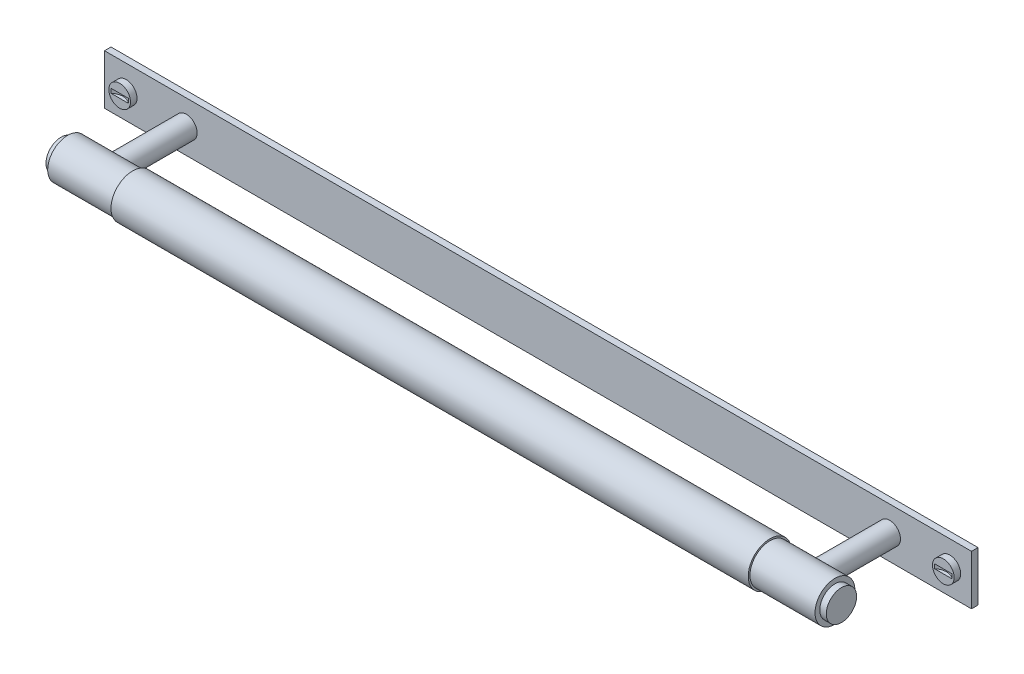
ISO-10303-21;
HEADER;
FILE_DESCRIPTION(('STEP AP214'),'2;1');
FILE_NAME('part.step','',(''),(''),'','','');
FILE_SCHEMA(('AUTOMOTIVE_DESIGN { 1 0 10303 214 1 1 1 1 }'));
ENDSEC;
DATA;
#1=APPLICATION_CONTEXT('core data for automotive mechanical design processes');
#2=APPLICATION_PROTOCOL_DEFINITION('international standard','automotive_design',2000,#1);
#3=PRODUCT_CONTEXT('',#1,'mechanical');
#4=PRODUCT('Part','Part','',(#3));
#5=PRODUCT_RELATED_PRODUCT_CATEGORY('part','',(#4));
#6=PRODUCT_DEFINITION_FORMATION('','',#4);
#7=PRODUCT_DEFINITION_CONTEXT('part definition',#1,'design');
#8=PRODUCT_DEFINITION('design','',#6,#7);
#9=PRODUCT_DEFINITION_SHAPE('','',#8);
#10=(LENGTH_UNIT() NAMED_UNIT(*) SI_UNIT(.MILLI.,.METRE.));
#11=(NAMED_UNIT(*) PLANE_ANGLE_UNIT() SI_UNIT($,.RADIAN.));
#12=(NAMED_UNIT(*) SI_UNIT($,.STERADIAN.) SOLID_ANGLE_UNIT());
#13=UNCERTAINTY_MEASURE_WITH_UNIT(LENGTH_MEASURE(1.E-05),#10,'distance_accuracy_value','');
#14=(GEOMETRIC_REPRESENTATION_CONTEXT(3) GLOBAL_UNCERTAINTY_ASSIGNED_CONTEXT((#13)) GLOBAL_UNIT_ASSIGNED_CONTEXT((#10,
#11,#12)) REPRESENTATION_CONTEXT('',''));
#15=CARTESIAN_POINT('',(0.,0.,0.));
#16=DIRECTION('',(0.,0.,1.));
#17=DIRECTION('',(1.,0.,0.));
#18=AXIS2_PLACEMENT_3D('',#15,#16,#17);
#19=CARTESIAN_POINT('',(200.,-11.5,-40.));
#20=DIRECTION('',(0.,0.,-1.));
#21=DIRECTION('',(-1.,0.,0.));
#22=AXIS2_PLACEMENT_3D('',#19,#20,#21);
#23=PLANE('',#22);
#24=CARTESIAN_POINT('',(-190.,0.,-40.));
#25=DIRECTION('',(0.,0.,-1.));
#26=DIRECTION('',(-1.,0.,0.));
#27=AXIS2_PLACEMENT_3D('',#24,#25,#26);
#28=CIRCLE('',#27,4.99999999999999);
#29=CARTESIAN_POINT('',(-195.,0.,-40.));
#30=VERTEX_POINT('',#29);
#31=EDGE_CURVE('E111',#30,#30,#28,.T.);
#32=ORIENTED_EDGE('',*,*,#31,.T.);
#33=EDGE_LOOP('',(#32));
#34=FACE_BOUND('',#33,.T.);
#35=CARTESIAN_POINT('',(162.25,0.,-40.));
#36=DIRECTION('',(0.,0.,-1.));
#37=DIRECTION('',(-1.,0.,0.));
#38=AXIS2_PLACEMENT_3D('',#35,#36,#37);
#39=CIRCLE('',#38,4.99999999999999);
#40=CARTESIAN_POINT('',(157.25,0.,-40.));
#41=VERTEX_POINT('',#40);
#42=EDGE_CURVE('E165',#41,#41,#39,.T.);
#43=ORIENTED_EDGE('',*,*,#42,.T.);
#44=EDGE_LOOP('',(#43));
#45=FACE_BOUND('',#44,.T.);
#46=DIRECTION('',(0.,-1.,0.));
#47=VECTOR('',#46,1.);
#48=CARTESIAN_POINT('',(-200.,-11.5,-40.));
#49=LINE('',#48,#47);
#50=CARTESIAN_POINT('',(-200.,11.5,-40.));
#51=VERTEX_POINT('',#50);
#52=CARTESIAN_POINT('',(-200.,-11.5,-40.));
#53=VERTEX_POINT('',#52);
#54=EDGE_CURVE('E148',#51,#53,#49,.T.);
#55=ORIENTED_EDGE('',*,*,#54,.T.);
#56=DIRECTION('',(-1.,0.,0.));
#57=VECTOR('',#56,1.);
#58=CARTESIAN_POINT('',(200.,-11.5,-40.));
#59=LINE('',#58,#57);
#60=CARTESIAN_POINT('',(200.,-11.5,-40.));
#61=VERTEX_POINT('',#60);
#62=EDGE_CURVE('E153',#61,#53,#59,.T.);
#63=ORIENTED_EDGE('',*,*,#62,.F.);
#64=DIRECTION('',(0.,-1.,0.));
#65=VECTOR('',#64,1.);
#66=CARTESIAN_POINT('',(200.,-11.5,-40.));
#67=LINE('',#66,#65);
#68=CARTESIAN_POINT('',(200.,11.5,-40.));
#69=VERTEX_POINT('',#68);
#70=EDGE_CURVE('E139',#69,#61,#67,.T.);
#71=ORIENTED_EDGE('',*,*,#70,.F.);
#72=DIRECTION('',(-1.,0.,0.));
#73=VECTOR('',#72,1.);
#74=CARTESIAN_POINT('',(200.,11.5,-40.));
#75=LINE('',#74,#73);
#76=EDGE_CURVE('E156',#69,#51,#75,.T.);
#77=ORIENTED_EDGE('',*,*,#76,.T.);
#78=EDGE_LOOP('',(#55,#63,#71,#77));
#79=FACE_BOUND('',#78,.T.);
#80=CARTESIAN_POINT('',(-162.25,0.,-40.));
#81=DIRECTION('',(0.,0.,-1.));
#82=DIRECTION('',(-1.,0.,0.));
#83=AXIS2_PLACEMENT_3D('',#80,#81,#82);
#84=CIRCLE('',#83,4.99999999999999);
#85=CARTESIAN_POINT('',(-167.25,0.,-40.));
#86=VERTEX_POINT('',#85);
#87=EDGE_CURVE('E162',#86,#86,#84,.F.);
#88=ORIENTED_EDGE('',*,*,#87,.F.);
#89=EDGE_LOOP('',(#88));
#90=FACE_BOUND('',#89,.T.);
#91=CARTESIAN_POINT('',(190.,0.,-40.));
#92=DIRECTION('',(0.,0.,-1.));
#93=DIRECTION('',(-1.,0.,0.));
#94=AXIS2_PLACEMENT_3D('',#91,#92,#93);
#95=CIRCLE('',#94,4.99999999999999);
#96=CARTESIAN_POINT('',(185.,0.,-40.));
#97=VERTEX_POINT('',#96);
#98=EDGE_CURVE('E285',#97,#97,#95,.F.);
#99=ORIENTED_EDGE('',*,*,#98,.F.);
#100=EDGE_LOOP('',(#99));
#101=FACE_BOUND('',#100,.T.);
#102=ADVANCED_FACE('F32',(#34,#45,#79,#90,#101),#23,.F.);
#103=CARTESIAN_POINT('',(177.,0.,0.));
#104=DIRECTION('',(-1.,0.,0.));
#105=DIRECTION('',(0.,0.,1.));
#106=AXIS2_PLACEMENT_3D('',#103,#104,#105);
#107=CYLINDRICAL_SURFACE('',#106,9.2);
#108=CARTESIAN_POINT('',(147.,0.,0.));
#109=DIRECTION('',(1.,0.,0.));
#110=DIRECTION('',(0.,0.,-1.));
#111=AXIS2_PLACEMENT_3D('',#108,#109,#110);
#112=CIRCLE('',#111,9.2);
#113=CARTESIAN_POINT('',(147.,0.,-9.2));
#114=VERTEX_POINT('',#113);
#115=EDGE_CURVE('E181',#114,#114,#112,.T.);
#116=ORIENTED_EDGE('',*,*,#115,.T.);
#117=EDGE_LOOP('',(#116));
#118=FACE_BOUND('',#117,.T.);
#119=CARTESIAN_POINT('',(177.,0.,0.));
#120=DIRECTION('',(1.,0.,0.));
#121=DIRECTION('',(0.,0.,-1.));
#122=AXIS2_PLACEMENT_3D('',#119,#120,#121);
#123=CIRCLE('',#122,9.2);
#124=CARTESIAN_POINT('',(177.,0.,-9.2));
#125=VERTEX_POINT('',#124);
#126=EDGE_CURVE('E184',#125,#125,#123,.T.);
#127=ORIENTED_EDGE('',*,*,#126,.F.);
#128=EDGE_LOOP('',(#127));
#129=FACE_BOUND('',#128,.T.);
#130=CARTESIAN_POINT('',(167.25,0.,-9.2));
#131=CARTESIAN_POINT('',(167.250001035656,-0.130074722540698,-9.20000090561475));
#132=CARTESIAN_POINT('',(167.244919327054,-0.260136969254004,-9.19723589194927));
#133=CARTESIAN_POINT('',(167.224659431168,-0.519285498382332,-9.18624856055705));
#134=CARTESIAN_POINT('',(167.209478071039,-0.648371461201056,-9.17802452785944));
#135=CARTESIAN_POINT('',(167.169189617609,-0.904665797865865,-9.15631689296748));
#136=CARTESIAN_POINT('',(167.144072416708,-1.03187212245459,-9.14282793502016));
#137=CARTESIAN_POINT('',(167.084208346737,-1.28341476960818,-9.11092364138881));
#138=CARTESIAN_POINT('',(167.04945754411,-1.40774989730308,-9.0925062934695));
#139=CARTESIAN_POINT('',(166.970895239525,-1.65213298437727,-9.05128374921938));
#140=CARTESIAN_POINT('',(166.927125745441,-1.77219789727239,-9.02849892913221));
#141=CARTESIAN_POINT('',(166.83086498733,-2.00796183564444,-8.9790104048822));
#142=CARTESIAN_POINT('',(166.778370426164,-2.12365919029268,-8.95230521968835));
#143=CARTESIAN_POINT('',(166.608525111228,-2.46316888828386,-8.86719116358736));
#144=CARTESIAN_POINT('',(166.478734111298,-2.67964052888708,-8.80374126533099));
#145=CARTESIAN_POINT('',(166.179944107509,-3.10276985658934,-8.66405646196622));
#146=CARTESIAN_POINT('',(166.008884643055,-3.30776927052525,-8.58724663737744));
#147=CARTESIAN_POINT('',(165.636938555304,-3.68774436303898,-8.4310608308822));
#148=CARTESIAN_POINT('',(165.436025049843,-3.86269267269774,-8.35168258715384));
#149=CARTESIAN_POINT('',(164.986960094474,-4.19453179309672,-8.19042783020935));
#150=CARTESIAN_POINT('',(164.736128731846,-4.34809630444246,-8.10903821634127));
#151=CARTESIAN_POINT('',(164.340003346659,-4.54463175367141,-7.99949849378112));
#152=CARTESIAN_POINT('',(164.20460087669,-4.60452242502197,-7.96506681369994));
#153=CARTESIAN_POINT('',(163.927917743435,-4.7123873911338,-7.90172843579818));
#154=CARTESIAN_POINT('',(163.786640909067,-4.76036931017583,-7.87281820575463));
#155=CARTESIAN_POINT('',(163.508188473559,-4.84114175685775,-7.82339132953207));
#156=CARTESIAN_POINT('',(163.371306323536,-4.87469290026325,-7.80246375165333));
#157=CARTESIAN_POINT('',(163.094408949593,-4.9302019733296,-7.76750851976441));
#158=CARTESIAN_POINT('',(162.954395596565,-4.95216664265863,-7.75347685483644));
#159=CARTESIAN_POINT('',(162.67258350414,-4.98412633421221,-7.73297147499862));
#160=CARTESIAN_POINT('',(162.530786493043,-4.99413215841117,-7.72649093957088));
#161=CARTESIAN_POINT('',(162.246722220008,-5.0020165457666,-7.72138953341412));
#162=CARTESIAN_POINT('',(162.104455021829,-4.99989669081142,-7.72276763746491));
#163=CARTESIAN_POINT('',(161.841925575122,-4.98478878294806,-7.73252471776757));
#164=CARTESIAN_POINT('',(161.721523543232,-4.97345607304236,-7.73983711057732));
#165=CARTESIAN_POINT('',(161.482260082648,-4.942179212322,-7.75984601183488));
#166=CARTESIAN_POINT('',(161.363399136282,-4.92223242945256,-7.77254416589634));
#167=CARTESIAN_POINT('',(161.12803831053,-4.87397481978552,-7.80289558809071));
#168=CARTESIAN_POINT('',(161.011538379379,-4.84566417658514,-7.82054874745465));
#169=CARTESIAN_POINT('',(160.781543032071,-4.78099629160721,-7.86024868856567));
#170=CARTESIAN_POINT('',(160.668048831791,-4.74463584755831,-7.88229721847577));
#171=CARTESIAN_POINT('',(160.328154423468,-4.62225510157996,-7.95511924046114));
#172=CARTESIAN_POINT('',(160.107319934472,-4.52396510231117,-8.01188661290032));
#173=CARTESIAN_POINT('',(159.684260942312,-4.29821090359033,-8.13522490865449));
#174=CARTESIAN_POINT('',(159.482044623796,-4.17073395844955,-8.20180011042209));
#175=CARTESIAN_POINT('',(159.069163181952,-3.86749973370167,-8.34955553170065));
#176=CARTESIAN_POINT('',(158.86196454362,-3.68733528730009,-8.43140910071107));
#177=CARTESIAN_POINT('',(158.479057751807,-3.29471585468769,-8.59242600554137));
#178=CARTESIAN_POINT('',(158.303370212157,-3.08223989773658,-8.67158755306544));
#179=CARTESIAN_POINT('',(158.061812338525,-2.73508983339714,-8.78495686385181));
#180=CARTESIAN_POINT('',(157.982990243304,-2.61045949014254,-8.82288451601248));
#181=CARTESIAN_POINT('',(157.836257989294,-2.35386813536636,-8.89477478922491));
#182=CARTESIAN_POINT('',(157.768343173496,-2.22191028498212,-8.92873910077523));
#183=CARTESIAN_POINT('',(157.644183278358,-1.95155644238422,-8.99170105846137));
#184=CARTESIAN_POINT('',(157.587932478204,-1.81316364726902,-9.02070113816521));
#185=CARTESIAN_POINT('',(157.487782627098,-1.53091383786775,-9.07286528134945));
#186=CARTESIAN_POINT('',(157.443881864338,-1.38705758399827,-9.09603015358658));
#187=CARTESIAN_POINT('',(157.372513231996,-1.10853590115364,-9.13395050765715));
#188=CARTESIAN_POINT('',(157.343906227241,-0.97424021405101,-9.14928303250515));
#189=CARTESIAN_POINT('',(157.297792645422,-0.703227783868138,-9.17409277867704));
#190=CARTESIAN_POINT('',(157.280284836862,-0.566511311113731,-9.18357064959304));
#191=CARTESIAN_POINT('',(157.256625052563,-0.29187989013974,-9.19639574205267));
#192=CARTESIAN_POINT('',(157.250467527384,-0.153965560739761,-9.19974595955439));
#193=CARTESIAN_POINT('',(157.24958386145,0.12190663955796,-9.20022611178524));
#194=CARTESIAN_POINT('',(157.25485701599,0.259864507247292,-9.19735642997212));
#195=CARTESIAN_POINT('',(157.275708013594,0.521504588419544,-9.18605000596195));
#196=CARTESIAN_POINT('',(157.290256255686,0.64529467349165,-9.17816969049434));
#197=CARTESIAN_POINT('',(157.328472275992,0.891088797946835,-9.15757479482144));
#198=CARTESIAN_POINT('',(157.352142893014,1.01309226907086,-9.1448587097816));
#199=CARTESIAN_POINT('',(157.408333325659,1.25443425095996,-9.11488727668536));
#200=CARTESIAN_POINT('',(157.440850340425,1.37377359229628,-9.09763336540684));
#201=CARTESIAN_POINT('',(157.514396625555,1.60912592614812,-9.05897178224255));
#202=CARTESIAN_POINT('',(157.555429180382,1.7251376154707,-9.0375625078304));
#203=CARTESIAN_POINT('',(157.692832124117,2.0724482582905,-8.9666859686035));
#204=CARTESIAN_POINT('',(157.80222449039,2.29754525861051,-8.91127618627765));
#205=CARTESIAN_POINT('',(158.051555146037,2.72668339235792,-8.78949008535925));
#206=CARTESIAN_POINT('',(158.191504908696,2.93071657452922,-8.72310964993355));
#207=CARTESIAN_POINT('',(158.515646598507,3.33604084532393,-8.5768397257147));
#208=CARTESIAN_POINT('',(158.703016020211,3.53454639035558,-8.49626779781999));
#209=CARTESIAN_POINT('',(159.107841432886,3.89884933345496,-8.3353877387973));
#210=CARTESIAN_POINT('',(159.325327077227,4.06461409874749,-8.25507994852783));
#211=CARTESIAN_POINT('',(159.679615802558,4.29124185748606,-8.13837911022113));
#212=CARTESIAN_POINT('',(159.807207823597,4.36516170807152,-8.0988551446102));
#213=CARTESIAN_POINT('',(160.069309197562,4.50182228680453,-8.02369412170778));
#214=CARTESIAN_POINT('',(160.203815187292,4.56456838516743,-7.98805520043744));
#215=CARTESIAN_POINT('',(160.478867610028,4.67816332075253,-7.92206455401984));
#216=CARTESIAN_POINT('',(160.619408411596,4.72902297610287,-7.89170802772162));
#217=CARTESIAN_POINT('',(160.905644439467,4.81821167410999,-7.83757391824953));
#218=CARTESIAN_POINT('',(161.051338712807,4.85654302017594,-7.81379512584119));
#219=CARTESIAN_POINT('',(161.332218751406,4.91693572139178,-7.77591708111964));
#220=CARTESIAN_POINT('',(161.467045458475,4.94021834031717,-7.76110050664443));
#221=CARTESIAN_POINT('',(161.738723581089,4.97567628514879,-7.7384167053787));
#222=CARTESIAN_POINT('',(161.875574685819,4.98785329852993,-7.73054842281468));
#223=CARTESIAN_POINT('',(162.149954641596,5.00088423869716,-7.72212521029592));
#224=CARTESIAN_POINT('',(162.287483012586,5.0017452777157,-7.72156568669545));
#225=CARTESIAN_POINT('',(162.561968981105,4.99214702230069,-7.72777464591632));
#226=CARTESIAN_POINT('',(162.698926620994,4.98168858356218,-7.73454257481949));
#227=CARTESIAN_POINT('',(162.953194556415,4.95173663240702,-7.7537456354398));
#228=CARTESIAN_POINT('',(163.070732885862,4.93360287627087,-7.7653243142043));
#229=CARTESIAN_POINT('',(163.303669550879,4.88915719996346,-7.79338335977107));
#230=CARTESIAN_POINT('',(163.419067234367,4.86284282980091,-7.8098651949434));
#231=CARTESIAN_POINT('',(163.760997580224,4.77204459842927,-7.86592091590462));
#232=CARTESIAN_POINT('',(163.983409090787,4.69568852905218,-7.91211668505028));
#233=CARTESIAN_POINT('',(164.426159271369,4.508414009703,-8.02038246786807));
#234=CARTESIAN_POINT('',(164.64549505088,4.39562987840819,-8.08326570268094));
#235=CARTESIAN_POINT('',(165.063636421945,4.14046696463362,-8.21688922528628));
#236=CARTESIAN_POINT('',(165.262430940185,3.99807234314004,-8.28763370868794));
#237=CARTESIAN_POINT('',(165.665342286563,3.66254871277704,-8.44184811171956));
#238=CARTESIAN_POINT('',(165.86567297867,3.46499766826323,-8.52561746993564));
#239=CARTESIAN_POINT('',(166.231654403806,3.03735701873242,-8.68715056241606));
#240=CARTESIAN_POINT('',(166.397281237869,2.8072451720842,-8.76491013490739));
#241=CARTESIAN_POINT('',(166.61800821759,2.43762496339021,-8.87216065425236));
#242=CARTESIAN_POINT('',(166.687800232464,2.30818012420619,-8.90679581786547));
#243=CARTESIAN_POINT('',(166.816072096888,2.04271439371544,-8.97139528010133));
#244=CARTESIAN_POINT('',(166.874557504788,1.90669677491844,-9.00136187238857));
#245=CARTESIAN_POINT('',(166.979411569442,1.62929850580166,-9.05567934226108));
#246=CARTESIAN_POINT('',(167.025803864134,1.48792894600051,-9.0800411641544));
#247=CARTESIAN_POINT('',(167.10595335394,1.20079805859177,-9.12245171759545));
#248=CARTESIAN_POINT('',(167.139717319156,1.05503912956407,-9.1405038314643));
#249=CARTESIAN_POINT('',(167.194445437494,0.758588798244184,-9.16989641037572));
#250=CARTESIAN_POINT('',(167.215246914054,0.607858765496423,-9.18115152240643));
#251=CARTESIAN_POINT('',(167.243023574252,0.30474678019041,-9.19620277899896));
#252=CARTESIAN_POINT('',(167.24999878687,0.152364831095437,-9.1999989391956));
#253=CARTESIAN_POINT('',(167.25,0.,-9.2));
#254=B_SPLINE_CURVE_WITH_KNOTS('',3,(#130,#131,#132,#133,#134,#135,#136,#137,#138,#139,#140,
#141,#142,#143,#144,#145,#146,#147,#148,#149,#150,#151,#152,#153,#154,#155,#156,#157,#158,#159,
#160,#161,#162,#163,#164,#165,#166,#167,#168,#169,#170,#171,#172,#173,#174,#175,#176,#177,#178,
#179,#180,#181,#182,#183,#184,#185,#186,#187,#188,#189,#190,#191,#192,#193,#194,#195,#196,#197,
#198,#199,#200,#201,#202,#203,#204,#205,#206,#207,#208,#209,#210,#211,#212,#213,#214,#215,#216,
#217,#218,#219,#220,#221,#222,#223,#224,#225,#226,#227,#228,#229,#230,#231,#232,#233,#234,#235,
#236,#237,#238,#239,#240,#241,#242,#243,#244,#245,#246,#247,#248,#249,#250,#251,#252,#253),
.UNSPECIFIED.,.T.,.F.,(4,2,2,2,2,2,2,2,2,2,2,2,2,2,2,2,2,2,2,2,2,2,2,2,2,2,2,2,2,2,2,2,2,2,2,2,
2,2,2,2,2,2,2,2,2,2,2,2,2,2,2,2,2,2,2,2,2,2,2,2,2,4),(0.,0.390074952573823,0.780272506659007,
1.1708680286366,1.56162327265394,1.95059798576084,2.33972002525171,3.11719990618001,
3.94734927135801,4.77825072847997,5.68860389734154,6.14407900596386,6.59926175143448,
7.02606566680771,7.45262104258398,7.87879083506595,8.30490503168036,8.66793889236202,
9.03108375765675,9.39422065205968,9.7575022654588,10.4992817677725,11.2413858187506,
12.0973849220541,12.9539419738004,13.4102132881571,13.8662892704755,14.3221410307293,
14.7779295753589,15.1918463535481,15.6057171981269,16.0193856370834,16.4330285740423,
16.8072633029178,17.1816145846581,17.5558474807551,17.9302249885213,18.6957960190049,
19.4616549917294,20.3120011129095,21.1631905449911,21.6206680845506,22.0779251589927,
22.5347644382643,22.9915196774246,23.4037762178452,23.815970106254,24.2279049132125,
24.6398085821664,24.9978688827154,25.3560365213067,26.0719476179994,26.8327119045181,
27.5938841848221,28.4707847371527,29.3482872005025,29.8010085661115,30.2535068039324,
30.7051138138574,31.1564783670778,31.6133990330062,32.0703187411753),.UNSPECIFIED.);
#255=CARTESIAN_POINT('',(167.25,0.,-9.2));
#256=VERTEX_POINT('',#255);
#257=EDGE_CURVE('E205',#256,#256,#254,.T.);
#258=ORIENTED_EDGE('',*,*,#257,.F.);
#259=EDGE_LOOP('',(#258));
#260=FACE_BOUND('',#259,.T.);
#261=ADVANCED_FACE('F241',(#118,#129,#260),#107,.T.);
#262=CARTESIAN_POINT('',(177.,0.,0.));
#263=DIRECTION('',(1.,0.,0.));
#264=DIRECTION('',(0.,0.,-1.));
#265=AXIS2_PLACEMENT_3D('',#262,#263,#264);
#266=PLANE('',#265);
#267=ORIENTED_EDGE('',*,*,#126,.T.);
#268=EDGE_LOOP('',(#267));
#269=FACE_BOUND('',#268,.T.);
#270=CARTESIAN_POINT('',(177.,0.,0.));
#271=DIRECTION('',(1.,0.,0.));
#272=DIRECTION('',(0.,0.,-1.));
#273=AXIS2_PLACEMENT_3D('',#270,#271,#272);
#274=CIRCLE('',#273,7.);
#275=CARTESIAN_POINT('',(177.,0.,-7.));
#276=VERTEX_POINT('',#275);
#277=EDGE_CURVE('E177',#276,#276,#274,.T.);
#278=ORIENTED_EDGE('',*,*,#277,.F.);
#279=EDGE_LOOP('',(#278));
#280=FACE_BOUND('',#279,.T.);
#281=ADVANCED_FACE('F247',(#269,#280),#266,.T.);
#282=CARTESIAN_POINT('',(147.,0.,0.));
#283=DIRECTION('',(1.,0.,0.));
#284=DIRECTION('',(0.,0.,-1.));
#285=AXIS2_PLACEMENT_3D('',#282,#283,#284);
#286=PLANE('',#285);
#287=CARTESIAN_POINT('',(147.,0.,0.));
#288=DIRECTION('',(1.,0.,0.));
#289=DIRECTION('',(0.,0.,-1.));
#290=AXIS2_PLACEMENT_3D('',#287,#288,#289);
#291=CIRCLE('',#290,10.);
#292=CARTESIAN_POINT('',(147.,0.,-10.));
#293=VERTEX_POINT('',#292);
#294=EDGE_CURVE('E187',#293,#293,#291,.T.);
#295=ORIENTED_EDGE('',*,*,#294,.T.);
#296=EDGE_LOOP('',(#295));
#297=FACE_BOUND('',#296,.T.);
#298=ORIENTED_EDGE('',*,*,#115,.F.);
#299=EDGE_LOOP('',(#298));
#300=FACE_BOUND('',#299,.T.);
#301=ADVANCED_FACE('F473',(#297,#300),#286,.T.);
#302=CARTESIAN_POINT('',(147.,0.,0.));
#303=DIRECTION('',(-1.,0.,0.));
#304=DIRECTION('',(0.,0.,1.));
#305=AXIS2_PLACEMENT_3D('',#302,#303,#304);
#306=CYLINDRICAL_SURFACE('',#305,10.);
#307=ORIENTED_EDGE('',*,*,#294,.F.);
#308=EDGE_LOOP('',(#307));
#309=FACE_BOUND('',#308,.T.);
#310=CARTESIAN_POINT('',(-147.,0.,0.));
#311=DIRECTION('',(1.,0.,0.));
#312=DIRECTION('',(0.,0.,-1.));
#313=AXIS2_PLACEMENT_3D('',#310,#311,#312);
#314=CIRCLE('',#313,10.);
#315=CARTESIAN_POINT('',(-147.,0.,-10.));
#316=VERTEX_POINT('',#315);
#317=EDGE_CURVE('E174',#316,#316,#314,.T.);
#318=ORIENTED_EDGE('',*,*,#317,.T.);
#319=EDGE_LOOP('',(#318));
#320=FACE_BOUND('',#319,.T.);
#321=ADVANCED_FACE('F34',(#309,#320),#306,.T.);
#322=CARTESIAN_POINT('',(180.,0.,0.));
#323=DIRECTION('',(-1.,0.,0.));
#324=DIRECTION('',(0.,0.,1.));
#325=AXIS2_PLACEMENT_3D('',#322,#323,#324);
#326=CYLINDRICAL_SURFACE('',#325,7.);
#327=CARTESIAN_POINT('',(180.,0.,0.));
#328=DIRECTION('',(1.,0.,0.));
#329=DIRECTION('',(0.,0.,-1.));
#330=AXIS2_PLACEMENT_3D('',#327,#328,#329);
#331=CIRCLE('',#330,7.);
#332=CARTESIAN_POINT('',(180.,0.,-7.));
#333=VERTEX_POINT('',#332);
#334=EDGE_CURVE('E178',#333,#333,#331,.T.);
#335=ORIENTED_EDGE('',*,*,#334,.F.);
#336=EDGE_LOOP('',(#335));
#337=FACE_BOUND('',#336,.T.);
#338=ORIENTED_EDGE('',*,*,#277,.T.);
#339=EDGE_LOOP('',(#338));
#340=FACE_BOUND('',#339,.T.);
#341=ADVANCED_FACE('F472',(#337,#340),#326,.T.);
#342=CARTESIAN_POINT('',(180.,0.,0.));
#343=DIRECTION('',(1.,0.,0.));
#344=DIRECTION('',(0.,0.,-1.));
#345=AXIS2_PLACEMENT_3D('',#342,#343,#344);
#346=PLANE('',#345);
#347=ORIENTED_EDGE('',*,*,#334,.T.);
#348=EDGE_LOOP('',(#347));
#349=FACE_BOUND('',#348,.T.);
#350=ADVANCED_FACE('F463',(#349),#346,.T.);
#351=CARTESIAN_POINT('',(-147.,0.,0.));
#352=DIRECTION('',(-1.,0.,0.));
#353=DIRECTION('',(0.,0.,-1.));
#354=AXIS2_PLACEMENT_3D('',#351,#352,#353);
#355=PLANE('',#354);
#356=CARTESIAN_POINT('',(-147.,0.,0.));
#357=DIRECTION('',(-1.,0.,0.));
#358=DIRECTION('',(0.,0.,1.));
#359=AXIS2_PLACEMENT_3D('',#356,#357,#358);
#360=CIRCLE('',#359,9.2);
#361=CARTESIAN_POINT('',(-147.,0.,9.2));
#362=VERTEX_POINT('',#361);
#363=EDGE_CURVE('E192',#362,#362,#360,.T.);
#364=ORIENTED_EDGE('',*,*,#363,.F.);
#365=EDGE_LOOP('',(#364));
#366=FACE_BOUND('',#365,.T.);
#367=ORIENTED_EDGE('',*,*,#317,.F.);
#368=EDGE_LOOP('',(#367));
#369=FACE_BOUND('',#368,.T.);
#370=ADVANCED_FACE('F236',(#366,#369),#355,.T.);
#371=CARTESIAN_POINT('',(-177.,0.,0.));
#372=DIRECTION('',(1.,0.,0.));
#373=DIRECTION('',(0.,0.,-1.));
#374=AXIS2_PLACEMENT_3D('',#371,#372,#373);
#375=CYLINDRICAL_SURFACE('',#374,9.2);
#376=CARTESIAN_POINT('',(-167.25,0.,-9.2));
#377=CARTESIAN_POINT('',(-167.250001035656,0.130074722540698,-9.20000090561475));
#378=CARTESIAN_POINT('',(-167.244919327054,0.260136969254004,-9.19723589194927));
#379=CARTESIAN_POINT('',(-167.224659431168,0.519285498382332,-9.18624856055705));
#380=CARTESIAN_POINT('',(-167.209478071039,0.648371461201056,-9.17802452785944));
#381=CARTESIAN_POINT('',(-167.169189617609,0.904665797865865,-9.15631689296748));
#382=CARTESIAN_POINT('',(-167.144072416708,1.03187212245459,-9.14282793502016));
#383=CARTESIAN_POINT('',(-167.084208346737,1.28341476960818,-9.11092364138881));
#384=CARTESIAN_POINT('',(-167.04945754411,1.40774989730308,-9.0925062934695));
#385=CARTESIAN_POINT('',(-166.970895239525,1.65213298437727,-9.05128374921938));
#386=CARTESIAN_POINT('',(-166.927125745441,1.77219789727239,-9.02849892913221));
#387=CARTESIAN_POINT('',(-166.83086498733,2.00796183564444,-8.9790104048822));
#388=CARTESIAN_POINT('',(-166.778370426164,2.12365919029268,-8.95230521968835));
#389=CARTESIAN_POINT('',(-166.608525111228,2.46316888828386,-8.86719116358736));
#390=CARTESIAN_POINT('',(-166.478734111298,2.67964052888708,-8.80374126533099));
#391=CARTESIAN_POINT('',(-166.179944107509,3.10276985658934,-8.66405646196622));
#392=CARTESIAN_POINT('',(-166.008884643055,3.30776927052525,-8.58724663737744));
#393=CARTESIAN_POINT('',(-165.636938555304,3.68774436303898,-8.4310608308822));
#394=CARTESIAN_POINT('',(-165.436025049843,3.86269267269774,-8.35168258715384));
#395=CARTESIAN_POINT('',(-164.986960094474,4.19453179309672,-8.19042783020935));
#396=CARTESIAN_POINT('',(-164.736128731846,4.34809630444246,-8.10903821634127));
#397=CARTESIAN_POINT('',(-164.340003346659,4.54463175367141,-7.99949849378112));
#398=CARTESIAN_POINT('',(-164.20460087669,4.60452242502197,-7.96506681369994));
#399=CARTESIAN_POINT('',(-163.927917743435,4.7123873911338,-7.90172843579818));
#400=CARTESIAN_POINT('',(-163.786640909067,4.76036931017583,-7.87281820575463));
#401=CARTESIAN_POINT('',(-163.508188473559,4.84114175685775,-7.82339132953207));
#402=CARTESIAN_POINT('',(-163.371306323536,4.87469290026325,-7.80246375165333));
#403=CARTESIAN_POINT('',(-163.094408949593,4.9302019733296,-7.76750851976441));
#404=CARTESIAN_POINT('',(-162.954395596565,4.95216664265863,-7.75347685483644));
#405=CARTESIAN_POINT('',(-162.67258350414,4.98412633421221,-7.73297147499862));
#406=CARTESIAN_POINT('',(-162.530786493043,4.99413215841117,-7.72649093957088));
#407=CARTESIAN_POINT('',(-162.246722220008,5.0020165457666,-7.72138953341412));
#408=CARTESIAN_POINT('',(-162.104455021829,4.99989669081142,-7.72276763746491));
#409=CARTESIAN_POINT('',(-161.841925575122,4.98478878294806,-7.73252471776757));
#410=CARTESIAN_POINT('',(-161.721523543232,4.97345607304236,-7.73983711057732));
#411=CARTESIAN_POINT('',(-161.482260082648,4.942179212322,-7.75984601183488));
#412=CARTESIAN_POINT('',(-161.363399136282,4.92223242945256,-7.77254416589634));
#413=CARTESIAN_POINT('',(-161.12803831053,4.87397481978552,-7.80289558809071));
#414=CARTESIAN_POINT('',(-161.011538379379,4.84566417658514,-7.82054874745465));
#415=CARTESIAN_POINT('',(-160.781543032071,4.78099629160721,-7.86024868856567));
#416=CARTESIAN_POINT('',(-160.668048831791,4.74463584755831,-7.88229721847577));
#417=CARTESIAN_POINT('',(-160.328154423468,4.62225510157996,-7.95511924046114));
#418=CARTESIAN_POINT('',(-160.107319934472,4.52396510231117,-8.01188661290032));
#419=CARTESIAN_POINT('',(-159.684260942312,4.29821090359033,-8.13522490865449));
#420=CARTESIAN_POINT('',(-159.482044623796,4.17073395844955,-8.20180011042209));
#421=CARTESIAN_POINT('',(-159.069163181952,3.86749973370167,-8.34955553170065));
#422=CARTESIAN_POINT('',(-158.86196454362,3.68733528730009,-8.43140910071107));
#423=CARTESIAN_POINT('',(-158.479057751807,3.29471585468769,-8.59242600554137));
#424=CARTESIAN_POINT('',(-158.303370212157,3.08223989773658,-8.67158755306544));
#425=CARTESIAN_POINT('',(-158.061812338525,2.73508983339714,-8.78495686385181));
#426=CARTESIAN_POINT('',(-157.982990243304,2.61045949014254,-8.82288451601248));
#427=CARTESIAN_POINT('',(-157.836257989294,2.35386813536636,-8.89477478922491));
#428=CARTESIAN_POINT('',(-157.768343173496,2.22191028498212,-8.92873910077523));
#429=CARTESIAN_POINT('',(-157.644183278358,1.95155644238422,-8.99170105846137));
#430=CARTESIAN_POINT('',(-157.587932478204,1.81316364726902,-9.02070113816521));
#431=CARTESIAN_POINT('',(-157.487782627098,1.53091383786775,-9.07286528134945));
#432=CARTESIAN_POINT('',(-157.443881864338,1.38705758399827,-9.09603015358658));
#433=CARTESIAN_POINT('',(-157.372513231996,1.10853590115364,-9.13395050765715));
#434=CARTESIAN_POINT('',(-157.343906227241,0.97424021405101,-9.14928303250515));
#435=CARTESIAN_POINT('',(-157.297792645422,0.703227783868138,-9.17409277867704));
#436=CARTESIAN_POINT('',(-157.280284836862,0.566511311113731,-9.18357064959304));
#437=CARTESIAN_POINT('',(-157.256625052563,0.29187989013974,-9.19639574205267));
#438=CARTESIAN_POINT('',(-157.250467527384,0.153965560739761,-9.19974595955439));
#439=CARTESIAN_POINT('',(-157.24958386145,-0.12190663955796,-9.20022611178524));
#440=CARTESIAN_POINT('',(-157.25485701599,-0.259864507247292,-9.19735642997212));
#441=CARTESIAN_POINT('',(-157.275708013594,-0.521504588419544,-9.18605000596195));
#442=CARTESIAN_POINT('',(-157.290256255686,-0.64529467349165,-9.17816969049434));
#443=CARTESIAN_POINT('',(-157.328472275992,-0.891088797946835,-9.15757479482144));
#444=CARTESIAN_POINT('',(-157.352142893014,-1.01309226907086,-9.1448587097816));
#445=CARTESIAN_POINT('',(-157.408333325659,-1.25443425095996,-9.11488727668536));
#446=CARTESIAN_POINT('',(-157.440850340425,-1.37377359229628,-9.09763336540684));
#447=CARTESIAN_POINT('',(-157.514396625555,-1.60912592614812,-9.05897178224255));
#448=CARTESIAN_POINT('',(-157.555429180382,-1.7251376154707,-9.0375625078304));
#449=CARTESIAN_POINT('',(-157.692832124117,-2.0724482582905,-8.9666859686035));
#450=CARTESIAN_POINT('',(-157.80222449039,-2.29754525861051,-8.91127618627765));
#451=CARTESIAN_POINT('',(-158.051555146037,-2.72668339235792,-8.78949008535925));
#452=CARTESIAN_POINT('',(-158.191504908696,-2.93071657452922,-8.72310964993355));
#453=CARTESIAN_POINT('',(-158.515646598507,-3.33604084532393,-8.5768397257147));
#454=CARTESIAN_POINT('',(-158.703016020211,-3.53454639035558,-8.49626779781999));
#455=CARTESIAN_POINT('',(-159.107841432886,-3.89884933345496,-8.3353877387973));
#456=CARTESIAN_POINT('',(-159.325327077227,-4.06461409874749,-8.25507994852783));
#457=CARTESIAN_POINT('',(-159.679615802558,-4.29124185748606,-8.13837911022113));
#458=CARTESIAN_POINT('',(-159.807207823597,-4.36516170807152,-8.0988551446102));
#459=CARTESIAN_POINT('',(-160.069309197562,-4.50182228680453,-8.02369412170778));
#460=CARTESIAN_POINT('',(-160.203815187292,-4.56456838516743,-7.98805520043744));
#461=CARTESIAN_POINT('',(-160.478867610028,-4.67816332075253,-7.92206455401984));
#462=CARTESIAN_POINT('',(-160.619408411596,-4.72902297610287,-7.89170802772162));
#463=CARTESIAN_POINT('',(-160.905644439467,-4.81821167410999,-7.83757391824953));
#464=CARTESIAN_POINT('',(-161.051338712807,-4.85654302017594,-7.81379512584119));
#465=CARTESIAN_POINT('',(-161.332218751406,-4.91693572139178,-7.77591708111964));
#466=CARTESIAN_POINT('',(-161.467045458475,-4.94021834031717,-7.76110050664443));
#467=CARTESIAN_POINT('',(-161.738723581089,-4.97567628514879,-7.7384167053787));
#468=CARTESIAN_POINT('',(-161.875574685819,-4.98785329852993,-7.73054842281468));
#469=CARTESIAN_POINT('',(-162.149954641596,-5.00088423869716,-7.72212521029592));
#470=CARTESIAN_POINT('',(-162.287483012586,-5.0017452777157,-7.72156568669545));
#471=CARTESIAN_POINT('',(-162.561968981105,-4.99214702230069,-7.72777464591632));
#472=CARTESIAN_POINT('',(-162.698926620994,-4.98168858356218,-7.73454257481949));
#473=CARTESIAN_POINT('',(-162.953194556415,-4.95173663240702,-7.7537456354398));
#474=CARTESIAN_POINT('',(-163.070732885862,-4.93360287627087,-7.7653243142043));
#475=CARTESIAN_POINT('',(-163.303669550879,-4.88915719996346,-7.79338335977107));
#476=CARTESIAN_POINT('',(-163.419067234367,-4.86284282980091,-7.8098651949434));
#477=CARTESIAN_POINT('',(-163.760997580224,-4.77204459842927,-7.86592091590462));
#478=CARTESIAN_POINT('',(-163.983409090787,-4.69568852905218,-7.91211668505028));
#479=CARTESIAN_POINT('',(-164.426159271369,-4.508414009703,-8.02038246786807));
#480=CARTESIAN_POINT('',(-164.64549505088,-4.39562987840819,-8.08326570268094));
#481=CARTESIAN_POINT('',(-165.063636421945,-4.14046696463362,-8.21688922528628));
#482=CARTESIAN_POINT('',(-165.262430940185,-3.99807234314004,-8.28763370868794));
#483=CARTESIAN_POINT('',(-165.665342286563,-3.66254871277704,-8.44184811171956));
#484=CARTESIAN_POINT('',(-165.86567297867,-3.46499766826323,-8.52561746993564));
#485=CARTESIAN_POINT('',(-166.231654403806,-3.03735701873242,-8.68715056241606));
#486=CARTESIAN_POINT('',(-166.397281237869,-2.8072451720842,-8.76491013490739));
#487=CARTESIAN_POINT('',(-166.61800821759,-2.43762496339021,-8.87216065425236));
#488=CARTESIAN_POINT('',(-166.687800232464,-2.30818012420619,-8.90679581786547));
#489=CARTESIAN_POINT('',(-166.816072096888,-2.04271439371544,-8.97139528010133));
#490=CARTESIAN_POINT('',(-166.874557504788,-1.90669677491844,-9.00136187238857));
#491=CARTESIAN_POINT('',(-166.979411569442,-1.62929850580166,-9.05567934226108));
#492=CARTESIAN_POINT('',(-167.025803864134,-1.48792894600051,-9.0800411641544));
#493=CARTESIAN_POINT('',(-167.10595335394,-1.20079805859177,-9.12245171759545));
#494=CARTESIAN_POINT('',(-167.139717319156,-1.05503912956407,-9.1405038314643));
#495=CARTESIAN_POINT('',(-167.194445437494,-0.758588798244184,-9.16989641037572));
#496=CARTESIAN_POINT('',(-167.215246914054,-0.607858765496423,-9.18115152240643));
#497=CARTESIAN_POINT('',(-167.243023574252,-0.30474678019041,-9.19620277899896));
#498=CARTESIAN_POINT('',(-167.24999878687,-0.152364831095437,-9.1999989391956));
#499=CARTESIAN_POINT('',(-167.25,0.,-9.2));
#500=B_SPLINE_CURVE_WITH_KNOTS('',3,(#376,#377,#378,#379,#380,#381,#382,#383,#384,#385,#386,
#387,#388,#389,#390,#391,#392,#393,#394,#395,#396,#397,#398,#399,#400,#401,#402,#403,#404,#405,
#406,#407,#408,#409,#410,#411,#412,#413,#414,#415,#416,#417,#418,#419,#420,#421,#422,#423,#424,
#425,#426,#427,#428,#429,#430,#431,#432,#433,#434,#435,#436,#437,#438,#439,#440,#441,#442,#443,
#444,#445,#446,#447,#448,#449,#450,#451,#452,#453,#454,#455,#456,#457,#458,#459,#460,#461,#462,
#463,#464,#465,#466,#467,#468,#469,#470,#471,#472,#473,#474,#475,#476,#477,#478,#479,#480,#481,
#482,#483,#484,#485,#486,#487,#488,#489,#490,#491,#492,#493,#494,#495,#496,#497,#498,#499),
.UNSPECIFIED.,.T.,.F.,(4,2,2,2,2,2,2,2,2,2,2,2,2,2,2,2,2,2,2,2,2,2,2,2,2,2,2,2,2,2,2,2,2,2,2,2,
2,2,2,2,2,2,2,2,2,2,2,2,2,2,2,2,2,2,2,2,2,2,2,2,2,4),(0.,0.390074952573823,0.780272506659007,
1.1708680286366,1.56162327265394,1.95059798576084,2.33972002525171,3.11719990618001,
3.94734927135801,4.77825072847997,5.68860389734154,6.14407900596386,6.59926175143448,
7.02606566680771,7.45262104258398,7.87879083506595,8.30490503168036,8.66793889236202,
9.03108375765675,9.39422065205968,9.7575022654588,10.4992817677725,11.2413858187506,
12.0973849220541,12.9539419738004,13.4102132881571,13.8662892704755,14.3221410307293,
14.7779295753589,15.1918463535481,15.6057171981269,16.0193856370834,16.4330285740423,
16.8072633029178,17.1816145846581,17.5558474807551,17.9302249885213,18.6957960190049,
19.4616549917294,20.3120011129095,21.1631905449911,21.6206680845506,22.0779251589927,
22.5347644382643,22.9915196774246,23.4037762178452,23.815970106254,24.2279049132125,
24.6398085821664,24.9978688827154,25.3560365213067,26.0719476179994,26.8327119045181,
27.5938841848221,28.4707847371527,29.3482872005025,29.8010085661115,30.2535068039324,
30.7051138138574,31.1564783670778,31.6133990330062,32.0703187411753),.UNSPECIFIED.);
#501=CARTESIAN_POINT('',(-167.25,0.,-9.2));
#502=VERTEX_POINT('',#501);
#503=EDGE_CURVE('E198',#502,#502,#500,.T.);
#504=ORIENTED_EDGE('',*,*,#503,.F.);
#505=EDGE_LOOP('',(#504));
#506=FACE_BOUND('',#505,.T.);
#507=CARTESIAN_POINT('',(-177.,0.,0.));
#508=DIRECTION('',(1.,0.,0.));
#509=DIRECTION('',(0.,0.,-1.));
#510=AXIS2_PLACEMENT_3D('',#507,#508,#509);
#511=CIRCLE('',#510,9.2);
#512=CARTESIAN_POINT('',(-177.,0.,-9.2));
#513=VERTEX_POINT('',#512);
#514=EDGE_CURVE('E171',#513,#513,#511,.T.);
#515=ORIENTED_EDGE('',*,*,#514,.T.);
#516=EDGE_LOOP('',(#515));
#517=FACE_BOUND('',#516,.T.);
#518=ORIENTED_EDGE('',*,*,#363,.T.);
#519=EDGE_LOOP('',(#518));
#520=FACE_BOUND('',#519,.T.);
#521=ADVANCED_FACE('F211',(#506,#517,#520),#375,.T.);
#522=CARTESIAN_POINT('',(-177.,0.,0.));
#523=DIRECTION('',(-1.,0.,0.));
#524=DIRECTION('',(0.,0.,-1.));
#525=AXIS2_PLACEMENT_3D('',#522,#523,#524);
#526=PLANE('',#525);
#527=CARTESIAN_POINT('',(-177.,0.,0.));
#528=DIRECTION('',(-1.,0.,0.));
#529=DIRECTION('',(0.,0.,1.));
#530=AXIS2_PLACEMENT_3D('',#527,#528,#529);
#531=CIRCLE('',#530,7.);
#532=CARTESIAN_POINT('',(-177.,0.,7.));
#533=VERTEX_POINT('',#532);
#534=EDGE_CURVE('E195',#533,#533,#531,.T.);
#535=ORIENTED_EDGE('',*,*,#534,.F.);
#536=EDGE_LOOP('',(#535));
#537=FACE_BOUND('',#536,.T.);
#538=ORIENTED_EDGE('',*,*,#514,.F.);
#539=EDGE_LOOP('',(#538));
#540=FACE_BOUND('',#539,.T.);
#541=ADVANCED_FACE('F229',(#537,#540),#526,.T.);
#542=CARTESIAN_POINT('',(-180.,0.,0.));
#543=DIRECTION('',(1.,0.,0.));
#544=DIRECTION('',(0.,0.,-1.));
#545=AXIS2_PLACEMENT_3D('',#542,#543,#544);
#546=CYLINDRICAL_SURFACE('',#545,7.);
#547=CARTESIAN_POINT('',(-180.,0.,0.));
#548=DIRECTION('',(1.,0.,0.));
#549=DIRECTION('',(0.,0.,-1.));
#550=AXIS2_PLACEMENT_3D('',#547,#548,#549);
#551=CIRCLE('',#550,7.);
#552=CARTESIAN_POINT('',(-180.,0.,-7.));
#553=VERTEX_POINT('',#552);
#554=EDGE_CURVE('E168',#553,#553,#551,.T.);
#555=ORIENTED_EDGE('',*,*,#554,.T.);
#556=EDGE_LOOP('',(#555));
#557=FACE_BOUND('',#556,.T.);
#558=ORIENTED_EDGE('',*,*,#534,.T.);
#559=EDGE_LOOP('',(#558));
#560=FACE_BOUND('',#559,.T.);
#561=ADVANCED_FACE('F226',(#557,#560),#546,.T.);
#562=CARTESIAN_POINT('',(-180.,0.,0.));
#563=DIRECTION('',(-1.,0.,0.));
#564=DIRECTION('',(0.,0.,-1.));
#565=AXIS2_PLACEMENT_3D('',#562,#563,#564);
#566=PLANE('',#565);
#567=ORIENTED_EDGE('',*,*,#554,.F.);
#568=EDGE_LOOP('',(#567));
#569=FACE_BOUND('',#568,.T.);
#570=ADVANCED_FACE('F220',(#569),#566,.T.);
#571=CARTESIAN_POINT('',(-162.25,0.,-40.));
#572=DIRECTION('',(0.,0.,1.));
#573=DIRECTION('',(1.,0.,0.));
#574=AXIS2_PLACEMENT_3D('',#571,#572,#573);
#575=CYLINDRICAL_SURFACE('',#574,4.99999999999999);
#576=ORIENTED_EDGE('',*,*,#503,.T.);
#577=EDGE_LOOP('',(#576));
#578=FACE_BOUND('',#577,.T.);
#579=ORIENTED_EDGE('',*,*,#87,.T.);
#580=EDGE_LOOP('',(#579));
#581=FACE_BOUND('',#580,.T.);
#582=ADVANCED_FACE('F215',(#578,#581),#575,.T.);
#583=CARTESIAN_POINT('',(162.25,0.,-40.));
#584=DIRECTION('',(0.,0.,1.));
#585=DIRECTION('',(1.,0.,0.));
#586=AXIS2_PLACEMENT_3D('',#583,#584,#585);
#587=CYLINDRICAL_SURFACE('',#586,4.99999999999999);
#588=ORIENTED_EDGE('',*,*,#42,.F.);
#589=EDGE_LOOP('',(#588));
#590=FACE_BOUND('',#589,.T.);
#591=ORIENTED_EDGE('',*,*,#257,.T.);
#592=EDGE_LOOP('',(#591));
#593=FACE_BOUND('',#592,.T.);
#594=ADVANCED_FACE('F219',(#590,#593),#587,.T.);
#595=CARTESIAN_POINT('',(200.,-11.5,-43.));
#596=DIRECTION('',(0.,0.,1.));
#597=DIRECTION('',(1.,0.,0.));
#598=AXIS2_PLACEMENT_3D('',#595,#596,#597);
#599=PLANE('',#598);
#600=DIRECTION('',(0.,1.,0.));
#601=VECTOR('',#600,1.);
#602=CARTESIAN_POINT('',(-200.,-11.5,-43.));
#603=LINE('',#602,#601);
#604=CARTESIAN_POINT('',(-200.,-11.5,-43.));
#605=VERTEX_POINT('',#604);
#606=CARTESIAN_POINT('',(-200.,11.5,-43.));
#607=VERTEX_POINT('',#606);
#608=EDGE_CURVE('E132',#605,#607,#603,.T.);
#609=ORIENTED_EDGE('',*,*,#608,.T.);
#610=DIRECTION('',(-1.,0.,0.));
#611=VECTOR('',#610,1.);
#612=CARTESIAN_POINT('',(200.,11.5,-43.));
#613=LINE('',#612,#611);
#614=CARTESIAN_POINT('',(200.,11.5,-43.));
#615=VERTEX_POINT('',#614);
#616=EDGE_CURVE('E159',#615,#607,#613,.T.);
#617=ORIENTED_EDGE('',*,*,#616,.F.);
#618=DIRECTION('',(0.,1.,0.));
#619=VECTOR('',#618,1.);
#620=CARTESIAN_POINT('',(200.,-11.5,-43.));
#621=LINE('',#620,#619);
#622=CARTESIAN_POINT('',(200.,-11.5,-43.));
#623=VERTEX_POINT('',#622);
#624=EDGE_CURVE('E133',#623,#615,#621,.T.);
#625=ORIENTED_EDGE('',*,*,#624,.F.);
#626=DIRECTION('',(-1.,0.,0.));
#627=VECTOR('',#626,1.);
#628=CARTESIAN_POINT('',(200.,-11.5,-43.));
#629=LINE('',#628,#627);
#630=EDGE_CURVE('E143',#623,#605,#629,.T.);
#631=ORIENTED_EDGE('',*,*,#630,.T.);
#632=EDGE_LOOP('',(#609,#617,#625,#631));
#633=FACE_BOUND('',#632,.T.);
#634=ADVANCED_FACE('F256',(#633),#599,.F.);
#635=CARTESIAN_POINT('',(200.,11.5,-40.));
#636=DIRECTION('',(0.,-1.,0.));
#637=DIRECTION('',(0.,0.,-1.));
#638=AXIS2_PLACEMENT_3D('',#635,#636,#637);
#639=PLANE('',#638);
#640=DIRECTION('',(0.,0.,1.));
#641=VECTOR('',#640,1.);
#642=CARTESIAN_POINT('',(-200.,11.5,-40.));
#643=LINE('',#642,#641);
#644=EDGE_CURVE('E146',#607,#51,#643,.T.);
#645=ORIENTED_EDGE('',*,*,#644,.T.);
#646=ORIENTED_EDGE('',*,*,#76,.F.);
#647=DIRECTION('',(0.,0.,1.));
#648=VECTOR('',#647,1.);
#649=CARTESIAN_POINT('',(200.,11.5,-40.));
#650=LINE('',#649,#648);
#651=EDGE_CURVE('E136',#615,#69,#650,.T.);
#652=ORIENTED_EDGE('',*,*,#651,.F.);
#653=ORIENTED_EDGE('',*,*,#616,.T.);
#654=EDGE_LOOP('',(#645,#646,#652,#653));
#655=FACE_BOUND('',#654,.T.);
#656=ADVANCED_FACE('F254',(#655),#639,.F.);
#657=CARTESIAN_POINT('',(200.,-11.5,-40.));
#658=DIRECTION('',(0.,1.,0.));
#659=DIRECTION('',(0.,0.,1.));
#660=AXIS2_PLACEMENT_3D('',#657,#658,#659);
#661=PLANE('',#660);
#662=DIRECTION('',(0.,0.,-1.));
#663=VECTOR('',#662,1.);
#664=CARTESIAN_POINT('',(-200.,-11.5,-40.));
#665=LINE('',#664,#663);
#666=EDGE_CURVE('E137',#53,#605,#665,.T.);
#667=ORIENTED_EDGE('',*,*,#666,.T.);
#668=ORIENTED_EDGE('',*,*,#630,.F.);
#669=DIRECTION('',(0.,0.,-1.));
#670=VECTOR('',#669,1.);
#671=CARTESIAN_POINT('',(200.,-11.5,-40.));
#672=LINE('',#671,#670);
#673=EDGE_CURVE('E141',#61,#623,#672,.T.);
#674=ORIENTED_EDGE('',*,*,#673,.F.);
#675=ORIENTED_EDGE('',*,*,#62,.T.);
#676=EDGE_LOOP('',(#667,#668,#674,#675));
#677=FACE_BOUND('',#676,.T.);
#678=ADVANCED_FACE('F252',(#677),#661,.F.);
#679=CARTESIAN_POINT('',(200.,0.,0.));
#680=DIRECTION('',(-1.,0.,0.));
#681=DIRECTION('',(0.,0.,1.));
#682=AXIS2_PLACEMENT_3D('',#679,#680,#681);
#683=PLANE('',#682);
#684=ORIENTED_EDGE('',*,*,#624,.T.);
#685=ORIENTED_EDGE('',*,*,#651,.T.);
#686=ORIENTED_EDGE('',*,*,#70,.T.);
#687=ORIENTED_EDGE('',*,*,#673,.T.);
#688=EDGE_LOOP('',(#684,#685,#686,#687));
#689=FACE_BOUND('',#688,.T.);
#690=ADVANCED_FACE('F275',(#689),#683,.F.);
#691=CARTESIAN_POINT('',(-200.,0.,0.));
#692=DIRECTION('',(-1.,0.,0.));
#693=DIRECTION('',(0.,0.,1.));
#694=AXIS2_PLACEMENT_3D('',#691,#692,#693);
#695=PLANE('',#694);
#696=ORIENTED_EDGE('',*,*,#608,.F.);
#697=ORIENTED_EDGE('',*,*,#666,.F.);
#698=ORIENTED_EDGE('',*,*,#54,.F.);
#699=ORIENTED_EDGE('',*,*,#644,.F.);
#700=EDGE_LOOP('',(#696,#697,#698,#699));
#701=FACE_BOUND('',#700,.T.);
#702=ADVANCED_FACE('F270',(#701),#695,.T.);
#703=CARTESIAN_POINT('',(190.,0.,-37.));
#704=DIRECTION('',(0.,0.,-1.));
#705=DIRECTION('',(-1.,0.,0.));
#706=AXIS2_PLACEMENT_3D('',#703,#704,#705);
#707=CYLINDRICAL_SURFACE('',#706,4.99999999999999);
#708=CARTESIAN_POINT('',(190.,0.,-37.));
#709=DIRECTION('',(0.,0.,1.));
#710=DIRECTION('',(1.,0.,0.));
#711=AXIS2_PLACEMENT_3D('',#708,#709,#710);
#712=CIRCLE('',#711,4.99999999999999);
#713=CARTESIAN_POINT('',(195.,0.,-37.));
#714=VERTEX_POINT('',#713);
#715=EDGE_CURVE('E127',#714,#714,#712,.T.);
#716=ORIENTED_EDGE('',*,*,#715,.F.);
#717=EDGE_LOOP('',(#716));
#718=FACE_BOUND('',#717,.T.);
#719=ORIENTED_EDGE('',*,*,#98,.T.);
#720=EDGE_LOOP('',(#719));
#721=FACE_BOUND('',#720,.T.);
#722=ADVANCED_FACE('F319',(#718,#721),#707,.T.);
#723=CARTESIAN_POINT('',(190.,0.,-37.));
#724=DIRECTION('',(0.,0.,1.));
#725=DIRECTION('',(1.,0.,0.));
#726=AXIS2_PLACEMENT_3D('',#723,#724,#725);
#727=PLANE('',#726);
#728=DIRECTION('',(1.,0.,0.));
#729=VECTOR('',#728,1.);
#730=CARTESIAN_POINT('',(190.,-1.,-37.));
#731=LINE('',#730,#729);
#732=CARTESIAN_POINT('',(186.,-1.,-37.));
#733=VERTEX_POINT('',#732);
#734=CARTESIAN_POINT('',(194.,-1.,-37.));
#735=VERTEX_POINT('',#734);
#736=EDGE_CURVE('E289',#733,#735,#731,.T.);
#737=ORIENTED_EDGE('',*,*,#736,.F.);
#738=DIRECTION('',(0.,1.,0.));
#739=VECTOR('',#738,1.);
#740=CARTESIAN_POINT('',(186.,-1.,-37.));
#741=LINE('',#740,#739);
#742=CARTESIAN_POINT('',(186.,1.,-37.));
#743=VERTEX_POINT('',#742);
#744=EDGE_CURVE('E123',#733,#743,#741,.T.);
#745=ORIENTED_EDGE('',*,*,#744,.T.);
#746=DIRECTION('',(1.,0.,0.));
#747=VECTOR('',#746,1.);
#748=CARTESIAN_POINT('',(190.,1.,-37.));
#749=LINE('',#748,#747);
#750=CARTESIAN_POINT('',(194.,1.,-37.));
#751=VERTEX_POINT('',#750);
#752=EDGE_CURVE('E287',#743,#751,#749,.T.);
#753=ORIENTED_EDGE('',*,*,#752,.T.);
#754=DIRECTION('',(0.,1.,0.));
#755=VECTOR('',#754,1.);
#756=CARTESIAN_POINT('',(194.,-1.,-37.));
#757=LINE('',#756,#755);
#758=EDGE_CURVE('E125',#735,#751,#757,.T.);
#759=ORIENTED_EDGE('',*,*,#758,.F.);
#760=EDGE_LOOP('',(#737,#745,#753,#759));
#761=FACE_BOUND('',#760,.T.);
#762=ORIENTED_EDGE('',*,*,#715,.T.);
#763=EDGE_LOOP('',(#762));
#764=FACE_BOUND('',#763,.T.);
#765=ADVANCED_FACE('F301',(#761,#764),#727,.T.);
#766=CARTESIAN_POINT('',(190.,-1.,-32.5278640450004));
#767=DIRECTION('',(0.,1.,0.));
#768=DIRECTION('',(0.,0.,1.));
#769=AXIS2_PLACEMENT_3D('',#766,#767,#768);
#770=CYLINDRICAL_SURFACE('',#769,6.);
#771=CARTESIAN_POINT('',(190.,1.,-32.5278640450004));
#772=DIRECTION('',(0.,1.,0.));
#773=DIRECTION('',(0.,0.,-1.));
#774=AXIS2_PLACEMENT_3D('',#771,#772,#773);
#775=CIRCLE('',#774,6.);
#776=EDGE_CURVE('E53',#751,#743,#775,.T.);
#777=ORIENTED_EDGE('',*,*,#776,.T.);
#778=ORIENTED_EDGE('',*,*,#744,.F.);
#779=CARTESIAN_POINT('',(190.,-1.,-32.5278640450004));
#780=DIRECTION('',(0.,1.,0.));
#781=DIRECTION('',(0.,0.,-1.));
#782=AXIS2_PLACEMENT_3D('',#779,#780,#781);
#783=CIRCLE('',#782,6.);
#784=EDGE_CURVE('E120',#735,#733,#783,.T.);
#785=ORIENTED_EDGE('',*,*,#784,.F.);
#786=ORIENTED_EDGE('',*,*,#758,.T.);
#787=EDGE_LOOP('',(#777,#778,#785,#786));
#788=FACE_BOUND('',#787,.T.);
#789=ADVANCED_FACE('F300',(#788),#770,.F.);
#790=CARTESIAN_POINT('',(190.,-1.,-32.5278640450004));
#791=DIRECTION('',(0.,-1.,0.));
#792=DIRECTION('',(0.,0.,-1.));
#793=AXIS2_PLACEMENT_3D('',#790,#791,#792);
#794=PLANE('',#793);
#795=ORIENTED_EDGE('',*,*,#736,.T.);
#796=ORIENTED_EDGE('',*,*,#784,.T.);
#797=EDGE_LOOP('',(#795,#796));
#798=FACE_BOUND('',#797,.T.);
#799=ADVANCED_FACE('F296',(#798),#794,.F.);
#800=CARTESIAN_POINT('',(190.,1.,-32.5278640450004));
#801=DIRECTION('',(0.,-1.,0.));
#802=DIRECTION('',(0.,0.,-1.));
#803=AXIS2_PLACEMENT_3D('',#800,#801,#802);
#804=PLANE('',#803);
#805=ORIENTED_EDGE('',*,*,#776,.F.);
#806=ORIENTED_EDGE('',*,*,#752,.F.);
#807=EDGE_LOOP('',(#805,#806));
#808=FACE_BOUND('',#807,.T.);
#809=ADVANCED_FACE('F303',(#808),#804,.T.);
#810=CARTESIAN_POINT('',(-190.,0.,-37.));
#811=DIRECTION('',(0.,0.,-1.));
#812=DIRECTION('',(-1.,0.,0.));
#813=AXIS2_PLACEMENT_3D('',#810,#811,#812);
#814=CYLINDRICAL_SURFACE('',#813,4.99999999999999);
#815=CARTESIAN_POINT('',(-190.,0.,-37.));
#816=DIRECTION('',(0.,0.,-1.));
#817=DIRECTION('',(-1.,0.,0.));
#818=AXIS2_PLACEMENT_3D('',#815,#816,#817);
#819=CIRCLE('',#818,4.99999999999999);
#820=CARTESIAN_POINT('',(-195.,0.,-37.));
#821=VERTEX_POINT('',#820);
#822=EDGE_CURVE('E114',#821,#821,#819,.T.);
#823=ORIENTED_EDGE('',*,*,#822,.T.);
#824=EDGE_LOOP('',(#823));
#825=FACE_BOUND('',#824,.T.);
#826=ORIENTED_EDGE('',*,*,#31,.F.);
#827=EDGE_LOOP('',(#826));
#828=FACE_BOUND('',#827,.T.);
#829=ADVANCED_FACE('F305',(#825,#828),#814,.T.);
#830=CARTESIAN_POINT('',(-190.,0.,-37.));
#831=DIRECTION('',(0.,0.,1.));
#832=DIRECTION('',(-1.,0.,0.));
#833=AXIS2_PLACEMENT_3D('',#830,#831,#832);
#834=PLANE('',#833);
#835=DIRECTION('',(1.,0.,0.));
#836=VECTOR('',#835,1.);
#837=CARTESIAN_POINT('',(-190.,-1.,-37.));
#838=LINE('',#837,#836);
#839=CARTESIAN_POINT('',(-194.,-1.,-37.));
#840=VERTEX_POINT('',#839);
#841=CARTESIAN_POINT('',(-186.,-1.,-37.));
#842=VERTEX_POINT('',#841);
#843=EDGE_CURVE('E11',#840,#842,#838,.T.);
#844=ORIENTED_EDGE('',*,*,#843,.F.);
#845=DIRECTION('',(0.,1.,0.));
#846=VECTOR('',#845,1.);
#847=CARTESIAN_POINT('',(-194.,-1.,-37.));
#848=LINE('',#847,#846);
#849=CARTESIAN_POINT('',(-194.,1.,-37.));
#850=VERTEX_POINT('',#849);
#851=EDGE_CURVE('E96',#840,#850,#848,.T.);
#852=ORIENTED_EDGE('',*,*,#851,.T.);
#853=DIRECTION('',(1.,0.,0.));
#854=VECTOR('',#853,1.);
#855=CARTESIAN_POINT('',(-190.,1.,-37.));
#856=LINE('',#855,#854);
#857=CARTESIAN_POINT('',(-186.,1.,-37.));
#858=VERTEX_POINT('',#857);
#859=EDGE_CURVE('E40',#850,#858,#856,.T.);
#860=ORIENTED_EDGE('',*,*,#859,.T.);
#861=DIRECTION('',(0.,1.,0.));
#862=VECTOR('',#861,1.);
#863=CARTESIAN_POINT('',(-186.,-1.,-37.));
#864=LINE('',#863,#862);
#865=EDGE_CURVE('E104',#842,#858,#864,.T.);
#866=ORIENTED_EDGE('',*,*,#865,.F.);
#867=EDGE_LOOP('',(#844,#852,#860,#866));
#868=FACE_BOUND('',#867,.T.);
#869=ORIENTED_EDGE('',*,*,#822,.F.);
#870=EDGE_LOOP('',(#869));
#871=FACE_BOUND('',#870,.T.);
#872=ADVANCED_FACE('F109',(#868,#871),#834,.T.);
#873=CARTESIAN_POINT('',(-190.,-1.,-32.5278640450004));
#874=DIRECTION('',(0.,1.,0.));
#875=DIRECTION('',(0.,0.,1.));
#876=AXIS2_PLACEMENT_3D('',#873,#874,#875);
#877=CYLINDRICAL_SURFACE('',#876,6.);
#878=CARTESIAN_POINT('',(-190.,1.,-32.5278640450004));
#879=DIRECTION('',(0.,-1.,0.));
#880=DIRECTION('',(0.,0.,-1.));
#881=AXIS2_PLACEMENT_3D('',#878,#879,#880);
#882=CIRCLE('',#881,6.);
#883=EDGE_CURVE('E46',#850,#858,#882,.T.);
#884=ORIENTED_EDGE('',*,*,#883,.F.);
#885=ORIENTED_EDGE('',*,*,#851,.F.);
#886=CARTESIAN_POINT('',(-190.,-1.,-32.5278640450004));
#887=DIRECTION('',(0.,-1.,0.));
#888=DIRECTION('',(0.,0.,-1.));
#889=AXIS2_PLACEMENT_3D('',#886,#887,#888);
#890=CIRCLE('',#889,6.);
#891=EDGE_CURVE('E99',#840,#842,#890,.T.);
#892=ORIENTED_EDGE('',*,*,#891,.T.);
#893=ORIENTED_EDGE('',*,*,#865,.T.);
#894=EDGE_LOOP('',(#884,#885,#892,#893));
#895=FACE_BOUND('',#894,.T.);
#896=ADVANCED_FACE('F98',(#895),#877,.F.);
#897=CARTESIAN_POINT('',(-190.,-1.,-32.5278640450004));
#898=DIRECTION('',(0.,-1.,0.));
#899=DIRECTION('',(0.,0.,-1.));
#900=AXIS2_PLACEMENT_3D('',#897,#898,#899);
#901=PLANE('',#900);
#902=ORIENTED_EDGE('',*,*,#843,.T.);
#903=ORIENTED_EDGE('',*,*,#891,.F.);
#904=EDGE_LOOP('',(#902,#903));
#905=FACE_BOUND('',#904,.T.);
#906=ADVANCED_FACE('F107',(#905),#901,.F.);
#907=CARTESIAN_POINT('',(-190.,1.,-32.5278640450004));
#908=DIRECTION('',(0.,-1.,0.));
#909=DIRECTION('',(0.,0.,-1.));
#910=AXIS2_PLACEMENT_3D('',#907,#908,#909);
#911=PLANE('',#910);
#912=ORIENTED_EDGE('',*,*,#883,.T.);
#913=ORIENTED_EDGE('',*,*,#859,.F.);
#914=EDGE_LOOP('',(#912,#913));
#915=FACE_BOUND('',#914,.T.);
#916=ADVANCED_FACE('F385',(#915),#911,.T.);
#917=CLOSED_SHELL('',(#102,#261,#281,#301,#321,#341,#350,#370,#521,#541,#561,#570,#582,#594,
#634,#656,#678,#690,#702,#722,#765,#789,#799,#809,#829,#872,#896,#906,#916));
#918=MANIFOLD_SOLID_BREP('B2',#917);
#919=ADVANCED_BREP_SHAPE_REPRESENTATION('',(#18,#918),#14);
#920=SHAPE_DEFINITION_REPRESENTATION(#9,#919);
ENDSEC;
END-ISO-10303-21;
